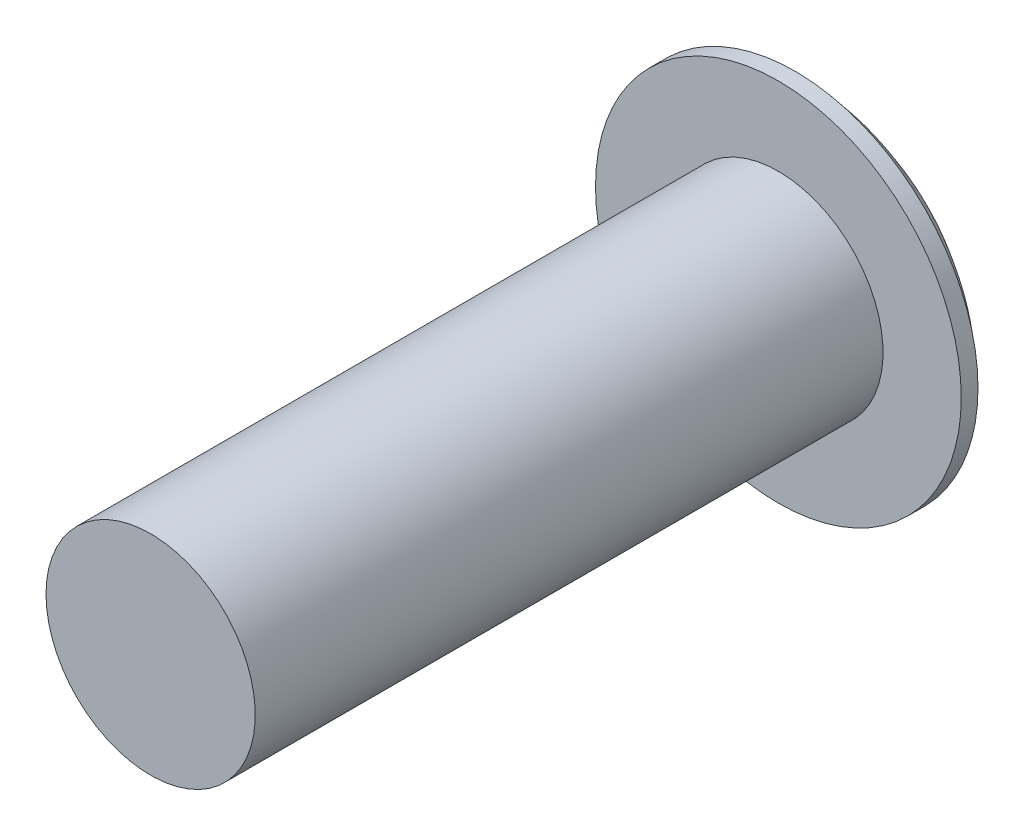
ISO-10303-21;
HEADER;
FILE_DESCRIPTION(('STEP AP214'),'2;1');
FILE_NAME('part.step','',(''),(''),'','','');
FILE_SCHEMA(('AUTOMOTIVE_DESIGN { 1 0 10303 214 1 1 1 1 }'));
ENDSEC;
DATA;
#1=APPLICATION_CONTEXT('core data for automotive mechanical design processes');
#2=APPLICATION_PROTOCOL_DEFINITION('international standard','automotive_design',2000,#1);
#3=PRODUCT_CONTEXT('',#1,'mechanical');
#4=PRODUCT('Part','Part','',(#3));
#5=PRODUCT_RELATED_PRODUCT_CATEGORY('part','',(#4));
#6=PRODUCT_DEFINITION_FORMATION('','',#4);
#7=PRODUCT_DEFINITION_CONTEXT('part definition',#1,'design');
#8=PRODUCT_DEFINITION('design','',#6,#7);
#9=PRODUCT_DEFINITION_SHAPE('','',#8);
#10=(LENGTH_UNIT() NAMED_UNIT(*) SI_UNIT(.MILLI.,.METRE.));
#11=(NAMED_UNIT(*) PLANE_ANGLE_UNIT() SI_UNIT($,.RADIAN.));
#12=(NAMED_UNIT(*) SI_UNIT($,.STERADIAN.) SOLID_ANGLE_UNIT());
#13=UNCERTAINTY_MEASURE_WITH_UNIT(LENGTH_MEASURE(1.E-05),#10,'distance_accuracy_value','');
#14=(GEOMETRIC_REPRESENTATION_CONTEXT(3) GLOBAL_UNCERTAINTY_ASSIGNED_CONTEXT((#13)) GLOBAL_UNIT_ASSIGNED_CONTEXT((#10,
#11,#12)) REPRESENTATION_CONTEXT('',''));
#15=CARTESIAN_POINT('',(0.,0.,0.));
#16=DIRECTION('',(0.,0.,1.));
#17=DIRECTION('',(1.,0.,0.));
#18=AXIS2_PLACEMENT_3D('',#15,#16,#17);
#19=CARTESIAN_POINT('',(0.,0.,0.));
#20=DIRECTION('',(0.,0.,-1.));
#21=DIRECTION('',(-1.,0.,0.));
#22=AXIS2_PLACEMENT_3D('',#19,#20,#21);
#23=PLANE('',#22);
#24=CARTESIAN_POINT('',(0.,0.,0.));
#25=DIRECTION('',(0.,0.,1.));
#26=DIRECTION('',(1.,0.,0.));
#27=AXIS2_PLACEMENT_3D('',#24,#25,#26);
#28=CIRCLE('',#27,5.5499);
#29=CARTESIAN_POINT('',(5.5499,0.,0.));
#30=VERTEX_POINT('',#29);
#31=EDGE_CURVE('E133',#30,#30,#28,.T.);
#32=ORIENTED_EDGE('',*,*,#31,.T.);
#33=EDGE_LOOP('',(#32));
#34=FACE_BOUND('',#33,.T.);
#35=CARTESIAN_POINT('',(0.,0.,0.));
#36=DIRECTION('',(0.,0.,-1.));
#37=DIRECTION('',(-1.,0.,0.));
#38=AXIS2_PLACEMENT_3D('',#35,#36,#37);
#39=CIRCLE('',#38,3.175);
#40=CARTESIAN_POINT('',(-3.175,0.,0.));
#41=VERTEX_POINT('',#40);
#42=EDGE_CURVE('E136',#41,#41,#39,.F.);
#43=ORIENTED_EDGE('',*,*,#42,.F.);
#44=EDGE_LOOP('',(#43));
#45=FACE_BOUND('',#44,.T.);
#46=ADVANCED_FACE('F34',(#34,#45),#23,.F.);
#47=CARTESIAN_POINT('',(0.,0.,0.));
#48=DIRECTION('',(0.,0.,1.));
#49=DIRECTION('',(1.,0.,0.));
#50=AXIS2_PLACEMENT_3D('',#47,#48,#49);
#51=CYLINDRICAL_SURFACE('',#50,5.5499);
#52=ORIENTED_EDGE('',*,*,#31,.F.);
#53=EDGE_LOOP('',(#52));
#54=FACE_BOUND('',#53,.T.);
#55=CARTESIAN_POINT('',(0.,0.,-0.508));
#56=DIRECTION('',(0.,0.,1.));
#57=DIRECTION('',(1.,0.,0.));
#58=AXIS2_PLACEMENT_3D('',#55,#56,#57);
#59=CIRCLE('',#58,5.5499);
#60=CARTESIAN_POINT('',(5.5499,0.,-0.508));
#61=VERTEX_POINT('',#60);
#62=EDGE_CURVE('E130',#61,#61,#59,.T.);
#63=ORIENTED_EDGE('',*,*,#62,.T.);
#64=EDGE_LOOP('',(#63));
#65=FACE_BOUND('',#64,.T.);
#66=ADVANCED_FACE('F171',(#54,#65),#51,.T.);
#67=CARTESIAN_POINT('',(0.,0.,9.02539299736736));
#68=DIRECTION('',(0.,0.,1.));
#69=DIRECTION('',(1.,0.,0.));
#70=AXIS2_PLACEMENT_3D('',#67,#68,#69);
#71=DEGENERATE_TOROIDAL_SURFACE('',#70,2.84083405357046,12.7,.F.);
#72=CARTESIAN_POINT('',(2.29037640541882,-0.0708635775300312,-2.59138067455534));
#73=CARTESIAN_POINT('',(2.25567942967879,-0.00624275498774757,-2.60758256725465));
#74=CARTESIAN_POINT('',(2.22084708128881,0.0586301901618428,-2.62247790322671));
#75=CARTESIAN_POINT('',(2.15092597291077,0.188853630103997,-2.64941897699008));
#76=CARTESIAN_POINT('',(2.11583713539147,0.254204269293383,-2.66146381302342));
#77=CARTESIAN_POINT('',(2.01022632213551,0.450897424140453,-2.69295759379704));
#78=CARTESIAN_POINT('',(1.93937398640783,0.582855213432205,-2.70775911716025));
#79=CARTESIAN_POINT('',(1.79865662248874,0.844931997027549,-2.72331205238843));
#80=CARTESIAN_POINT('',(1.72879796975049,0.975039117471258,-2.72432152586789));
#81=CARTESIAN_POINT('',(1.5893735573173,1.23470786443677,-2.71284578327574));
#82=CARTESIAN_POINT('',(1.5198076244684,1.36426981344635,-2.70037017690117));
#83=CARTESIAN_POINT('',(1.43017703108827,1.53120086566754,-2.67629611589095));
#84=CARTESIAN_POINT('',(1.40974747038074,1.56924957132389,-2.67026532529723));
#85=CARTESIAN_POINT('',(1.36896306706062,1.64520782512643,-2.65718442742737));
#86=CARTESIAN_POINT('',(1.34860821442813,1.68311739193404,-2.65013446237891));
#87=CARTESIAN_POINT('',(1.30786343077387,1.75900185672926,-2.63501613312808));
#88=CARTESIAN_POINT('',(1.28747396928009,1.79697588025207,-2.6269421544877));
#89=CARTESIAN_POINT('',(1.24678187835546,1.87276220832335,-2.60985441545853));
#90=CARTESIAN_POINT('',(1.2264792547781,1.91057450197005,-2.60084059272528));
#91=CARTESIAN_POINT('',(1.20622357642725,1.94829936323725,-2.59138067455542));
#92=B_SPLINE_CURVE_WITH_KNOTS('',3,(#72,#73,#74,#75,#76,#77,#78,#79,#80,#81,#82,#83,#84,#85,#86,
#87,#88,#89,#90,#91),.UNSPECIFIED.,.F.,.F.,(4,2,2,2,2,2,2,2,2,4),(0.,0.225322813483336,
0.450716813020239,0.901595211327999,1.34402546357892,1.78614064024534,1.9169519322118,
2.04774498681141,2.17928894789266,2.31084164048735),.UNSPECIFIED.);
#93=CARTESIAN_POINT('',(2.29026901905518,-0.0706635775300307,-2.59143082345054));
#94=VERTEX_POINT('',#93);
#95=CARTESIAN_POINT('',(1.20633096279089,1.94809936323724,-2.59143082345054));
#96=VERTEX_POINT('',#95);
#97=EDGE_CURVE('E46',#94,#96,#92,.T.);
#98=ORIENTED_EDGE('',*,*,#97,.T.);
#99=CARTESIAN_POINT('',(1.20653096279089,1.94809319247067,-2.59138662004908));
#100=CARTESIAN_POINT('',(1.13321953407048,1.95035513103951,-2.60758810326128));
#101=CARTESIAN_POINT('',(1.05962208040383,1.95262589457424,-2.62248302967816));
#102=CARTESIAN_POINT('',(0.9118854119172,1.95718413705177,-2.64942328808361));
#103=CARTESIAN_POINT('',(0.837746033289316,1.95947162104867,-2.66146771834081));
#104=CARTESIAN_POINT('',(0.614600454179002,1.96635651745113,-2.69296029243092));
#105=CARTESIAN_POINT('',(0.464896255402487,1.97097546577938,-2.7077610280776));
#106=CARTESIAN_POINT('',(0.167573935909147,1.98014899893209,-2.72331251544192));
#107=CARTESIAN_POINT('',(0.0199692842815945,1.98470316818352,-2.7243213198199));
#108=CARTESIAN_POINT('',(-0.274621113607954,1.99379241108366,-2.71284440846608));
#109=CARTESIAN_POINT('',(-0.421607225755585,1.99832749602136,-2.70036830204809));
#110=CARTESIAN_POINT('',(-0.610984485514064,2.00417051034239,-2.67629416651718));
#111=CARTESIAN_POINT('',(-0.654146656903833,2.00550222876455,-2.67026380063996));
#112=CARTESIAN_POINT('',(-0.740313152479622,2.00816079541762,-2.65718393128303));
#113=CARTESIAN_POINT('',(-0.783317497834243,2.00948764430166,-2.6501345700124));
#114=CARTESIAN_POINT('',(-0.869400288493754,2.01214362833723,-2.63501762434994));
#115=CARTESIAN_POINT('',(-0.912477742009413,2.01347273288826,-2.62694442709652));
#116=CARTESIAN_POINT('',(-0.998449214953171,2.01612528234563,-2.60985840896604));
#117=CARTESIAN_POINT('',(-1.04134322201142,2.01744872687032,-2.60084552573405));
#118=CARTESIAN_POINT('',(-1.0841380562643,2.01876911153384,-2.59138662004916));
#119=B_SPLINE_CURVE_WITH_KNOTS('',3,(#99,#100,#101,#102,#103,#104,#105,#106,#107,#108,#109,#110,
#111,#112,#113,#114,#115,#116,#117,#118),.UNSPECIFIED.,.F.,.F.,(4,2,2,2,2,2,2,2,2,4),(0.,
0.225321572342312,0.450714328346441,0.901590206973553,1.34401821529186,1.78613115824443,
1.9169311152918,2.04771283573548,2.17924531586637,2.31078652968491),.UNSPECIFIED.);
#120=CARTESIAN_POINT('',(-1.08393805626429,2.01876294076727,-2.59143082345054));
#121=VERTEX_POINT('',#120);
#122=EDGE_CURVE('E11',#96,#121,#119,.T.);
#123=ORIENTED_EDGE('',*,*,#122,.T.);
#124=CARTESIAN_POINT('',(-1.08381420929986,2.01896294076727,-2.59137885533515));
#125=CARTESIAN_POINT('',(-1.12242904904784,1.9566039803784,-2.60758087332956));
#126=CARTESIAN_POINT('',(-1.16119454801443,1.89400172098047,-2.62247633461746));
#127=CARTESIAN_POINT('',(-1.23901091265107,1.76833636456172,-2.64941765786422));
#128=CARTESIAN_POINT('',(-1.27806186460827,1.70527312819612,-2.66146261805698));
#129=CARTESIAN_POINT('',(-1.39559790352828,1.51546461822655,-2.69295676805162));
#130=CARTESIAN_POINT('',(-1.47445065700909,1.3881256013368,-2.70775853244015));
#131=CARTESIAN_POINT('',(-1.63105737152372,1.13522200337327,-2.72331191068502));
#132=CARTESIAN_POINT('',(-1.70880423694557,1.00966888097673,-2.72432158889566));
#133=CARTESIAN_POINT('',(-1.86397201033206,0.759089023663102,-2.71284620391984));
#134=CARTESIAN_POINT('',(-1.94139311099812,0.634061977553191,-2.7003707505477));
#135=CARTESIAN_POINT('',(-2.04114508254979,0.47297289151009,-2.67629671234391));
#136=CARTESIAN_POINT('',(-2.06388205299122,0.436255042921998,-2.67026579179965));
#137=CARTESIAN_POINT('',(-2.10927283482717,0.362953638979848,-2.65718457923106));
#138=CARTESIAN_POINT('',(-2.13192665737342,0.326370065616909,-2.65013442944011));
#139=CARTESIAN_POINT('',(-2.1772733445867,0.253139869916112,-2.6350156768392));
#140=CARTESIAN_POINT('',(-2.19996568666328,0.216494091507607,-2.62694145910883));
#141=CARTESIAN_POINT('',(-2.24525372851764,0.143358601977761,-2.60985319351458));
#142=CARTESIAN_POINT('',(-2.26784942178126,0.106868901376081,-2.60083908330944));
#143=CARTESIAN_POINT('',(-2.29039286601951,0.0704635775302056,-2.59137885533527));
#144=B_SPLINE_CURVE_WITH_KNOTS('',3,(#124,#125,#126,#127,#128,#129,#130,#131,#132,#133,#134,
#135,#136,#137,#138,#139,#140,#141,#142,#143),.UNSPECIFIED.,.F.,.F.,(4,2,2,2,2,2,2,2,2,4),(0.,
0.225323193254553,0.450717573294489,0.901596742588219,1.34402768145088,1.7861435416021,
1.91695830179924,2.04775482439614,2.17930229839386,2.31085850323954),.UNSPECIFIED.);
#145=CARTESIAN_POINT('',(-2.29026901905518,0.0706635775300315,-2.59143082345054));
#146=VERTEX_POINT('',#145);
#147=EDGE_CURVE('E92',#121,#146,#144,.T.);
#148=ORIENTED_EDGE('',*,*,#147,.T.);
#149=CARTESIAN_POINT('',(-2.29037640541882,0.0708635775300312,-2.59138067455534));
#150=CARTESIAN_POINT('',(-2.25567942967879,0.00624275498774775,-2.60758256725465));
#151=CARTESIAN_POINT('',(-2.22084708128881,-0.0586301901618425,-2.62247790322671));
#152=CARTESIAN_POINT('',(-2.15092597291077,-0.188853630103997,-2.64941897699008));
#153=CARTESIAN_POINT('',(-2.11583713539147,-0.254204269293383,-2.66146381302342));
#154=CARTESIAN_POINT('',(-2.01022632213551,-0.450897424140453,-2.69295759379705));
#155=CARTESIAN_POINT('',(-1.93937398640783,-0.582855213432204,-2.70775911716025));
#156=CARTESIAN_POINT('',(-1.79865662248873,-0.844931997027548,-2.72331205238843));
#157=CARTESIAN_POINT('',(-1.72879796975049,-0.975039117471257,-2.72432152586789));
#158=CARTESIAN_POINT('',(-1.58937355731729,-1.23470786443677,-2.71284578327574));
#159=CARTESIAN_POINT('',(-1.5198076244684,-1.36426981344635,-2.70037017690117));
#160=CARTESIAN_POINT('',(-1.43017703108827,-1.53120086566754,-2.67629611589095));
#161=CARTESIAN_POINT('',(-1.40974747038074,-1.56924957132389,-2.67026532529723));
#162=CARTESIAN_POINT('',(-1.36896306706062,-1.64520782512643,-2.65718442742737));
#163=CARTESIAN_POINT('',(-1.34860821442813,-1.68311739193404,-2.65013446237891));
#164=CARTESIAN_POINT('',(-1.30786343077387,-1.75900185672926,-2.63501613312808));
#165=CARTESIAN_POINT('',(-1.28747396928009,-1.79697588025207,-2.6269421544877));
#166=CARTESIAN_POINT('',(-1.24678187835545,-1.87276220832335,-2.60985441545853));
#167=CARTESIAN_POINT('',(-1.2264792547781,-1.91057450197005,-2.60084059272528));
#168=CARTESIAN_POINT('',(-1.20622357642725,-1.94829936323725,-2.59138067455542));
#169=B_SPLINE_CURVE_WITH_KNOTS('',3,(#149,#150,#151,#152,#153,#154,#155,#156,#157,#158,#159,
#160,#161,#162,#163,#164,#165,#166,#167,#168),.UNSPECIFIED.,.F.,.F.,(4,2,2,2,2,2,2,2,2,4),(0.,
0.225322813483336,0.450716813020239,0.901595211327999,1.34402546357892,1.78614064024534,
1.9169519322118,2.04774498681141,2.17928894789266,2.31084164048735),.UNSPECIFIED.);
#170=CARTESIAN_POINT('',(-1.20633096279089,-1.94809936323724,-2.59143082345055));
#171=VERTEX_POINT('',#170);
#172=EDGE_CURVE('E144',#146,#171,#169,.T.);
#173=ORIENTED_EDGE('',*,*,#172,.T.);
#174=CARTESIAN_POINT('',(-1.20653096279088,-1.94809319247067,-2.59138662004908));
#175=CARTESIAN_POINT('',(-1.13321953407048,-1.95035513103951,-2.60758810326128));
#176=CARTESIAN_POINT('',(-1.05962208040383,-1.95262589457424,-2.62248302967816));
#177=CARTESIAN_POINT('',(-0.911885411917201,-1.95718413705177,-2.64942328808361));
#178=CARTESIAN_POINT('',(-0.837746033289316,-1.95947162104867,-2.66146771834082));
#179=CARTESIAN_POINT('',(-0.614600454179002,-1.96635651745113,-2.69296029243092));
#180=CARTESIAN_POINT('',(-0.464896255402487,-1.97097546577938,-2.7077610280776));
#181=CARTESIAN_POINT('',(-0.167573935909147,-1.98014899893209,-2.72331251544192));
#182=CARTESIAN_POINT('',(-0.0199692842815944,-1.98470316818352,-2.7243213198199));
#183=CARTESIAN_POINT('',(0.274621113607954,-1.99379241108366,-2.71284440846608));
#184=CARTESIAN_POINT('',(0.421607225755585,-1.99832749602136,-2.70036830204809));
#185=CARTESIAN_POINT('',(0.610984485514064,-2.00417051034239,-2.67629416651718));
#186=CARTESIAN_POINT('',(0.654146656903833,-2.00550222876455,-2.67026380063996));
#187=CARTESIAN_POINT('',(0.740313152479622,-2.00816079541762,-2.65718393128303));
#188=CARTESIAN_POINT('',(0.783317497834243,-2.00948764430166,-2.6501345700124));
#189=CARTESIAN_POINT('',(0.869400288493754,-2.01214362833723,-2.63501762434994));
#190=CARTESIAN_POINT('',(0.912477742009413,-2.01347273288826,-2.62694442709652));
#191=CARTESIAN_POINT('',(0.998449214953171,-2.01612528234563,-2.60985840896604));
#192=CARTESIAN_POINT('',(1.04134322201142,-2.01744872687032,-2.60084552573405));
#193=CARTESIAN_POINT('',(1.0841380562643,-2.01876911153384,-2.59138662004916));
#194=B_SPLINE_CURVE_WITH_KNOTS('',3,(#174,#175,#176,#177,#178,#179,#180,#181,#182,#183,#184,
#185,#186,#187,#188,#189,#190,#191,#192,#193),.UNSPECIFIED.,.F.,.F.,(4,2,2,2,2,2,2,2,2,4),(0.,
0.225321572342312,0.45071432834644,0.901590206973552,1.34401821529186,1.78613115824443,
1.9169311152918,2.04771283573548,2.17924531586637,2.31078652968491),.UNSPECIFIED.);
#195=CARTESIAN_POINT('',(1.08393805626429,-2.01876294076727,-2.59143082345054));
#196=VERTEX_POINT('',#195);
#197=EDGE_CURVE('E272',#171,#196,#194,.T.);
#198=ORIENTED_EDGE('',*,*,#197,.T.);
#199=CARTESIAN_POINT('',(1.08381420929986,-2.01896294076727,-2.59137885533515));
#200=CARTESIAN_POINT('',(1.12242904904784,-1.9566039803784,-2.60758087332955));
#201=CARTESIAN_POINT('',(1.16119454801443,-1.89400172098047,-2.62247633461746));
#202=CARTESIAN_POINT('',(1.23901091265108,-1.76833636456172,-2.64941765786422));
#203=CARTESIAN_POINT('',(1.27806186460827,-1.70527312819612,-2.66146261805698));
#204=CARTESIAN_POINT('',(1.39559790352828,-1.51546461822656,-2.69295676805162));
#205=CARTESIAN_POINT('',(1.47445065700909,-1.3881256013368,-2.70775853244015));
#206=CARTESIAN_POINT('',(1.63105737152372,-1.13522200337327,-2.72331191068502));
#207=CARTESIAN_POINT('',(1.70880423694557,-1.00966888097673,-2.72432158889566));
#208=CARTESIAN_POINT('',(1.86397201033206,-0.759089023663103,-2.71284620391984));
#209=CARTESIAN_POINT('',(1.94139311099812,-0.634061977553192,-2.7003707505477));
#210=CARTESIAN_POINT('',(2.04114508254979,-0.472972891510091,-2.67629671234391));
#211=CARTESIAN_POINT('',(2.06388205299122,-0.436255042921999,-2.67026579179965));
#212=CARTESIAN_POINT('',(2.10927283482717,-0.362953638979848,-2.65718457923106));
#213=CARTESIAN_POINT('',(2.13192665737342,-0.326370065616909,-2.65013442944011));
#214=CARTESIAN_POINT('',(2.1772733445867,-0.253139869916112,-2.6350156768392));
#215=CARTESIAN_POINT('',(2.19996568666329,-0.216494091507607,-2.62694145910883));
#216=CARTESIAN_POINT('',(2.24525372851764,-0.14335860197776,-2.60985319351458));
#217=CARTESIAN_POINT('',(2.26784942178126,-0.106868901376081,-2.60083908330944));
#218=CARTESIAN_POINT('',(2.29039286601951,-0.0704635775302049,-2.59137885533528));
#219=B_SPLINE_CURVE_WITH_KNOTS('',3,(#199,#200,#201,#202,#203,#204,#205,#206,#207,#208,#209,
#210,#211,#212,#213,#214,#215,#216,#217,#218),.UNSPECIFIED.,.F.,.F.,(4,2,2,2,2,2,2,2,2,4),(0.,
0.225323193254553,0.450717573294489,0.901596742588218,1.34402768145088,1.7861435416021,
1.91695830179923,2.04775482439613,2.17930229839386,2.31085850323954),.UNSPECIFIED.);
#220=EDGE_CURVE('E267',#196,#94,#219,.T.);
#221=ORIENTED_EDGE('',*,*,#220,.T.);
#222=EDGE_LOOP('',(#98,#123,#148,#173,#198,#221));
#223=FACE_BOUND('',#222,.T.);
#224=ORIENTED_EDGE('',*,*,#62,.F.);
#225=EDGE_LOOP('',(#224));
#226=FACE_BOUND('',#225,.T.);
#227=ADVANCED_FACE('F150',(#223,#226),#71,.F.);
#228=CARTESIAN_POINT('',(0.,0.,19.05));
#229=DIRECTION('',(0.,0.,-1.));
#230=DIRECTION('',(-1.,0.,0.));
#231=AXIS2_PLACEMENT_3D('',#228,#229,#230);
#232=CYLINDRICAL_SURFACE('',#231,3.175);
#233=CARTESIAN_POINT('',(0.,0.,19.05));
#234=DIRECTION('',(0.,0.,1.));
#235=DIRECTION('',(1.,0.,0.));
#236=AXIS2_PLACEMENT_3D('',#233,#234,#235);
#237=CIRCLE('',#236,3.175);
#238=CARTESIAN_POINT('',(-3.175,0.,19.05));
#239=VERTEX_POINT('',#238);
#240=EDGE_CURVE('E120',#239,#239,#237,.T.);
#241=CARTESIAN_POINT('',(-3.175,0.,19.05));
#242=CARTESIAN_POINT('',(-3.175,0.,18.8515625));
#243=CARTESIAN_POINT('',(-3.175,0.,18.653125));
#244=CARTESIAN_POINT('',(-3.175,0.,18.25625));
#245=CARTESIAN_POINT('',(-3.175,0.,18.0578125));
#246=CARTESIAN_POINT('',(-3.175,0.,17.6609375));
#247=CARTESIAN_POINT('',(-3.175,0.,17.4625));
#248=CARTESIAN_POINT('',(-3.175,0.,17.065625));
#249=CARTESIAN_POINT('',(-3.175,0.,16.8671875));
#250=CARTESIAN_POINT('',(-3.175,0.,16.4703125));
#251=CARTESIAN_POINT('',(-3.175,0.,16.271875));
#252=CARTESIAN_POINT('',(-3.175,0.,15.875));
#253=CARTESIAN_POINT('',(-3.175,0.,15.6765625));
#254=CARTESIAN_POINT('',(-3.175,0.,15.2796875));
#255=CARTESIAN_POINT('',(-3.175,0.,15.08125));
#256=CARTESIAN_POINT('',(-3.175,0.,14.684375));
#257=CARTESIAN_POINT('',(-3.175,0.,14.4859375));
#258=CARTESIAN_POINT('',(-3.175,0.,14.0890625));
#259=CARTESIAN_POINT('',(-3.175,0.,13.890625));
#260=CARTESIAN_POINT('',(-3.175,0.,13.49375));
#261=CARTESIAN_POINT('',(-3.175,0.,13.2953125));
#262=CARTESIAN_POINT('',(-3.175,0.,12.8984375));
#263=CARTESIAN_POINT('',(-3.175,0.,12.7));
#264=CARTESIAN_POINT('',(-3.175,0.,12.303125));
#265=CARTESIAN_POINT('',(-3.175,0.,12.1046875));
#266=CARTESIAN_POINT('',(-3.175,0.,11.7078125));
#267=CARTESIAN_POINT('',(-3.175,0.,11.509375));
#268=CARTESIAN_POINT('',(-3.175,0.,11.1125));
#269=CARTESIAN_POINT('',(-3.175,0.,10.9140625));
#270=CARTESIAN_POINT('',(-3.175,0.,10.5171875));
#271=CARTESIAN_POINT('',(-3.175,0.,10.31875));
#272=CARTESIAN_POINT('',(-3.175,0.,9.921875));
#273=CARTESIAN_POINT('',(-3.175,0.,9.7234375));
#274=CARTESIAN_POINT('',(-3.175,0.,9.3265625));
#275=CARTESIAN_POINT('',(-3.175,0.,9.128125));
#276=CARTESIAN_POINT('',(-3.175,0.,8.73125));
#277=CARTESIAN_POINT('',(-3.175,0.,8.5328125));
#278=CARTESIAN_POINT('',(-3.175,0.,8.1359375));
#279=CARTESIAN_POINT('',(-3.175,0.,7.9375));
#280=CARTESIAN_POINT('',(-3.175,0.,7.540625));
#281=CARTESIAN_POINT('',(-3.175,0.,7.3421875));
#282=CARTESIAN_POINT('',(-3.175,0.,6.9453125));
#283=CARTESIAN_POINT('',(-3.175,0.,6.746875));
#284=CARTESIAN_POINT('',(-3.175,0.,6.35));
#285=CARTESIAN_POINT('',(-3.175,0.,6.1515625));
#286=CARTESIAN_POINT('',(-3.175,0.,5.7546875));
#287=CARTESIAN_POINT('',(-3.175,0.,5.55625));
#288=CARTESIAN_POINT('',(-3.175,0.,5.159375));
#289=CARTESIAN_POINT('',(-3.175,0.,4.9609375));
#290=CARTESIAN_POINT('',(-3.175,0.,4.5640625));
#291=CARTESIAN_POINT('',(-3.175,0.,4.365625));
#292=CARTESIAN_POINT('',(-3.175,0.,3.96875));
#293=CARTESIAN_POINT('',(-3.175,0.,3.7703125));
#294=CARTESIAN_POINT('',(-3.175,0.,3.3734375));
#295=CARTESIAN_POINT('',(-3.175,0.,3.175));
#296=CARTESIAN_POINT('',(-3.175,0.,2.778125));
#297=CARTESIAN_POINT('',(-3.175,0.,2.5796875));
#298=CARTESIAN_POINT('',(-3.175,0.,2.1828125));
#299=CARTESIAN_POINT('',(-3.175,0.,1.984375));
#300=CARTESIAN_POINT('',(-3.175,0.,1.5875));
#301=CARTESIAN_POINT('',(-3.175,0.,1.3890625));
#302=CARTESIAN_POINT('',(-3.175,0.,0.992187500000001));
#303=CARTESIAN_POINT('',(-3.175,0.,0.793750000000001));
#304=CARTESIAN_POINT('',(-3.175,0.,0.396875));
#305=CARTESIAN_POINT('',(-3.175,0.,0.1984375));
#306=CARTESIAN_POINT('',(-3.175,0.,0.));
#307=B_SPLINE_CURVE_WITH_KNOTS('',3,(#241,#242,#243,#244,#245,#246,#247,#248,#249,#250,#251,
#252,#253,#254,#255,#256,#257,#258,#259,#260,#261,#262,#263,#264,#265,#266,#267,#268,#269,#270,
#271,#272,#273,#274,#275,#276,#277,#278,#279,#280,#281,#282,#283,#284,#285,#286,#287,#288,#289,
#290,#291,#292,#293,#294,#295,#296,#297,#298,#299,#300,#301,#302,#303,#304,#305,#306),
.UNSPECIFIED.,.F.,.F.,(4,2,2,2,2,2,2,2,2,2,2,2,2,2,2,2,2,2,2,2,2,2,2,2,2,2,2,2,2,2,2,2,4),(0.,
0.595312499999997,1.190625,1.7859375,2.38125,2.9765625,3.571875,4.1671875,4.7625,5.3578125,
5.953125,6.5484375,7.14375,7.7390625,8.334375,8.9296875,9.525,10.1203125,10.715625,11.3109375,
11.90625,12.5015625,13.096875,13.6921875,14.2875,14.8828125,15.478125,16.0734375,16.66875,
17.2640625,17.859375,18.4546875,19.05),.UNSPECIFIED.);
#308=EDGE_CURVE('BSEAM164',#239,#41,#307,.T.);
#309=ORIENTED_EDGE('',*,*,#240,.F.);
#310=ORIENTED_EDGE('',*,*,#42,.T.);
#311=ORIENTED_EDGE('',*,*,#308,.T.);
#312=ORIENTED_EDGE('',*,*,#308,.F.);
#313=EDGE_LOOP('',(#309,#311,#310,#312));
#314=FACE_BOUND('',#313,.T.);
#315=ADVANCED_FACE('F164',(#314),#232,.T.);
#316=CARTESIAN_POINT('',(0.,0.,19.05));
#317=DIRECTION('',(0.,0.,1.));
#318=DIRECTION('',(1.,0.,0.));
#319=AXIS2_PLACEMENT_3D('',#316,#317,#318);
#320=PLANE('',#319);
#321=ORIENTED_EDGE('',*,*,#240,.T.);
#322=EDGE_LOOP('',(#321));
#323=FACE_BOUND('',#322,.T.);
#324=ADVANCED_FACE('F162',(#323),#320,.T.);
#325=CARTESIAN_POINT('',(1.20633096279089,1.94809936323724,-6.35));
#326=DIRECTION('',(0.0308391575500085,0.999524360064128,0.));
#327=DIRECTION('',(-0.999524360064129,0.0308391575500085,0.));
#328=AXIS2_PLACEMENT_3D('',#325,#326,#327);
#329=PLANE('',#328);
#330=DIRECTION('',(0.,0.,1.));
#331=VECTOR('',#330,1.);
#332=CARTESIAN_POINT('',(1.20633096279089,1.94809936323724,-6.35));
#333=LINE('',#332,#331);
#334=CARTESIAN_POINT('',(1.20633096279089,1.94809936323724,0.));
#335=VERTEX_POINT('',#334);
#336=EDGE_CURVE('E108',#96,#335,#333,.T.);
#337=ORIENTED_EDGE('',*,*,#336,.T.);
#338=DIRECTION('',(-0.999524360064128,0.0308391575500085,0.));
#339=VECTOR('',#338,1.);
#340=CARTESIAN_POINT('',(1.20633096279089,1.94809936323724,0.));
#341=LINE('',#340,#339);
#342=CARTESIAN_POINT('',(-1.08393805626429,2.01876294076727,0.));
#343=VERTEX_POINT('',#342);
#344=EDGE_CURVE('E101',#335,#343,#341,.T.);
#345=ORIENTED_EDGE('',*,*,#344,.T.);
#346=DIRECTION('',(0.,0.,1.));
#347=VECTOR('',#346,1.);
#348=CARTESIAN_POINT('',(-1.08393805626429,2.01876294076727,-6.35));
#349=LINE('',#348,#347);
#350=EDGE_CURVE('E87',#121,#343,#349,.T.);
#351=ORIENTED_EDGE('',*,*,#350,.F.);
#352=ORIENTED_EDGE('',*,*,#122,.F.);
#353=EDGE_LOOP('',(#337,#345,#351,#352));
#354=FACE_BOUND('',#353,.T.);
#355=ADVANCED_FACE('F107',(#354),#329,.F.);
#356=CARTESIAN_POINT('',(2.29026901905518,-0.0706635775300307,-6.35));
#357=DIRECTION('',(0.881033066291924,0.473054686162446,0.));
#358=DIRECTION('',(-0.473054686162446,0.881033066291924,0.));
#359=AXIS2_PLACEMENT_3D('',#356,#357,#358);
#360=PLANE('',#359);
#361=DIRECTION('',(0.,0.,1.));
#362=VECTOR('',#361,1.);
#363=CARTESIAN_POINT('',(2.29026901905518,-0.0706635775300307,-6.35));
#364=LINE('',#363,#362);
#365=CARTESIAN_POINT('',(2.29026901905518,-0.0706635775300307,0.));
#366=VERTEX_POINT('',#365);
#367=EDGE_CURVE('E121',#94,#366,#364,.T.);
#368=ORIENTED_EDGE('',*,*,#367,.T.);
#369=DIRECTION('',(-0.473054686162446,0.881033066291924,0.));
#370=VECTOR('',#369,1.);
#371=CARTESIAN_POINT('',(2.29026901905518,-0.0706635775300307,0.));
#372=LINE('',#371,#370);
#373=EDGE_CURVE('E94',#366,#335,#372,.T.);
#374=ORIENTED_EDGE('',*,*,#373,.T.);
#375=ORIENTED_EDGE('',*,*,#336,.F.);
#376=ORIENTED_EDGE('',*,*,#97,.F.);
#377=EDGE_LOOP('',(#368,#374,#375,#376));
#378=FACE_BOUND('',#377,.T.);
#379=ADVANCED_FACE('F161',(#378),#360,.F.);
#380=CARTESIAN_POINT('',(1.08393805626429,-2.01876294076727,-6.35));
#381=DIRECTION('',(0.850193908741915,-0.526469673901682,0.));
#382=DIRECTION('',(0.526469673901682,0.850193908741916,0.));
#383=AXIS2_PLACEMENT_3D('',#380,#381,#382);
#384=PLANE('',#383);
#385=DIRECTION('',(0.,0.,1.));
#386=VECTOR('',#385,1.);
#387=CARTESIAN_POINT('',(1.08393805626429,-2.01876294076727,-6.35));
#388=LINE('',#387,#386);
#389=CARTESIAN_POINT('',(1.08393805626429,-2.01876294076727,0.));
#390=VERTEX_POINT('',#389);
#391=EDGE_CURVE('E123',#196,#390,#388,.T.);
#392=ORIENTED_EDGE('',*,*,#391,.T.);
#393=DIRECTION('',(0.526469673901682,0.850193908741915,0.));
#394=VECTOR('',#393,1.);
#395=CARTESIAN_POINT('',(1.08393805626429,-2.01876294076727,0.));
#396=LINE('',#395,#394);
#397=EDGE_CURVE('E115',#390,#366,#396,.T.);
#398=ORIENTED_EDGE('',*,*,#397,.T.);
#399=ORIENTED_EDGE('',*,*,#367,.F.);
#400=ORIENTED_EDGE('',*,*,#220,.F.);
#401=EDGE_LOOP('',(#392,#398,#399,#400));
#402=FACE_BOUND('',#401,.T.);
#403=ADVANCED_FACE('F215',(#402),#384,.F.);
#404=CARTESIAN_POINT('',(-1.20633096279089,-1.94809936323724,-6.35));
#405=DIRECTION('',(-0.0308391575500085,-0.999524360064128,0.));
#406=DIRECTION('',(0.999524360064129,-0.0308391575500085,0.));
#407=AXIS2_PLACEMENT_3D('',#404,#405,#406);
#408=PLANE('',#407);
#409=DIRECTION('',(0.,0.,1.));
#410=VECTOR('',#409,1.);
#411=CARTESIAN_POINT('',(-1.20633096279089,-1.94809936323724,-6.35));
#412=LINE('',#411,#410);
#413=CARTESIAN_POINT('',(-1.20633096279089,-1.94809936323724,0.));
#414=VERTEX_POINT('',#413);
#415=EDGE_CURVE('E125',#171,#414,#412,.T.);
#416=ORIENTED_EDGE('',*,*,#415,.T.);
#417=DIRECTION('',(0.999524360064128,-0.0308391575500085,0.));
#418=VECTOR('',#417,1.);
#419=CARTESIAN_POINT('',(-1.20633096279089,-1.94809936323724,0.));
#420=LINE('',#419,#418);
#421=EDGE_CURVE('E112',#414,#390,#420,.T.);
#422=ORIENTED_EDGE('',*,*,#421,.T.);
#423=ORIENTED_EDGE('',*,*,#391,.F.);
#424=ORIENTED_EDGE('',*,*,#197,.F.);
#425=EDGE_LOOP('',(#416,#422,#423,#424));
#426=FACE_BOUND('',#425,.T.);
#427=ADVANCED_FACE('F225',(#426),#408,.F.);
#428=CARTESIAN_POINT('',(-2.29026901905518,0.0706635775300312,-6.35));
#429=DIRECTION('',(-0.881033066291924,-0.473054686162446,0.));
#430=DIRECTION('',(0.473054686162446,-0.881033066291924,0.));
#431=AXIS2_PLACEMENT_3D('',#428,#429,#430);
#432=PLANE('',#431);
#433=DIRECTION('',(0.,0.,1.));
#434=VECTOR('',#433,1.);
#435=CARTESIAN_POINT('',(-2.29026901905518,0.0706635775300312,-6.35));
#436=LINE('',#435,#434);
#437=CARTESIAN_POINT('',(-2.29026901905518,0.0706635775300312,0.));
#438=VERTEX_POINT('',#437);
#439=EDGE_CURVE('E53',#146,#438,#436,.T.);
#440=ORIENTED_EDGE('',*,*,#439,.T.);
#441=DIRECTION('',(0.473054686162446,-0.881033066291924,0.));
#442=VECTOR('',#441,1.);
#443=CARTESIAN_POINT('',(-2.29026901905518,0.0706635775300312,0.));
#444=LINE('',#443,#442);
#445=EDGE_CURVE('E105',#438,#414,#444,.T.);
#446=ORIENTED_EDGE('',*,*,#445,.T.);
#447=ORIENTED_EDGE('',*,*,#415,.F.);
#448=ORIENTED_EDGE('',*,*,#172,.F.);
#449=EDGE_LOOP('',(#440,#446,#447,#448));
#450=FACE_BOUND('',#449,.T.);
#451=ADVANCED_FACE('F155',(#450),#432,.F.);
#452=CARTESIAN_POINT('',(-1.08393805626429,2.01876294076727,-6.35));
#453=DIRECTION('',(-0.850193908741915,0.526469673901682,0.));
#454=DIRECTION('',(-0.526469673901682,-0.850193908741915,0.));
#455=AXIS2_PLACEMENT_3D('',#452,#453,#454);
#456=PLANE('',#455);
#457=ORIENTED_EDGE('',*,*,#350,.T.);
#458=DIRECTION('',(-0.526469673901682,-0.850193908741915,0.));
#459=VECTOR('',#458,1.);
#460=CARTESIAN_POINT('',(-1.08393805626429,2.01876294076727,0.));
#461=LINE('',#460,#459);
#462=EDGE_CURVE('E90',#343,#438,#461,.T.);
#463=ORIENTED_EDGE('',*,*,#462,.T.);
#464=ORIENTED_EDGE('',*,*,#439,.F.);
#465=ORIENTED_EDGE('',*,*,#147,.F.);
#466=EDGE_LOOP('',(#457,#463,#464,#465));
#467=FACE_BOUND('',#466,.T.);
#468=ADVANCED_FACE('F89',(#467),#456,.F.);
#469=CARTESIAN_POINT('',(-1.08393805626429,2.01876294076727,0.));
#470=DIRECTION('',(0.,0.,1.));
#471=DIRECTION('',(1.,0.,0.));
#472=AXIS2_PLACEMENT_3D('',#469,#470,#471);
#473=PLANE('',#472);
#474=ORIENTED_EDGE('',*,*,#344,.F.);
#475=ORIENTED_EDGE('',*,*,#373,.F.);
#476=ORIENTED_EDGE('',*,*,#397,.F.);
#477=ORIENTED_EDGE('',*,*,#421,.F.);
#478=ORIENTED_EDGE('',*,*,#445,.F.);
#479=ORIENTED_EDGE('',*,*,#462,.F.);
#480=EDGE_LOOP('',(#474,#475,#476,#477,#478,#479));
#481=FACE_BOUND('',#480,.T.);
#482=ADVANCED_FACE('F99',(#481),#473,.F.);
#483=CLOSED_SHELL('',(#46,#66,#227,#315,#324,#355,#379,#403,#427,#451,#468,#482));
#484=MANIFOLD_SOLID_BREP('B2',#483);
#485=ADVANCED_BREP_SHAPE_REPRESENTATION('',(#18,#484),#14);
#486=SHAPE_DEFINITION_REPRESENTATION(#9,#485);
ENDSEC;
END-ISO-10303-21;
